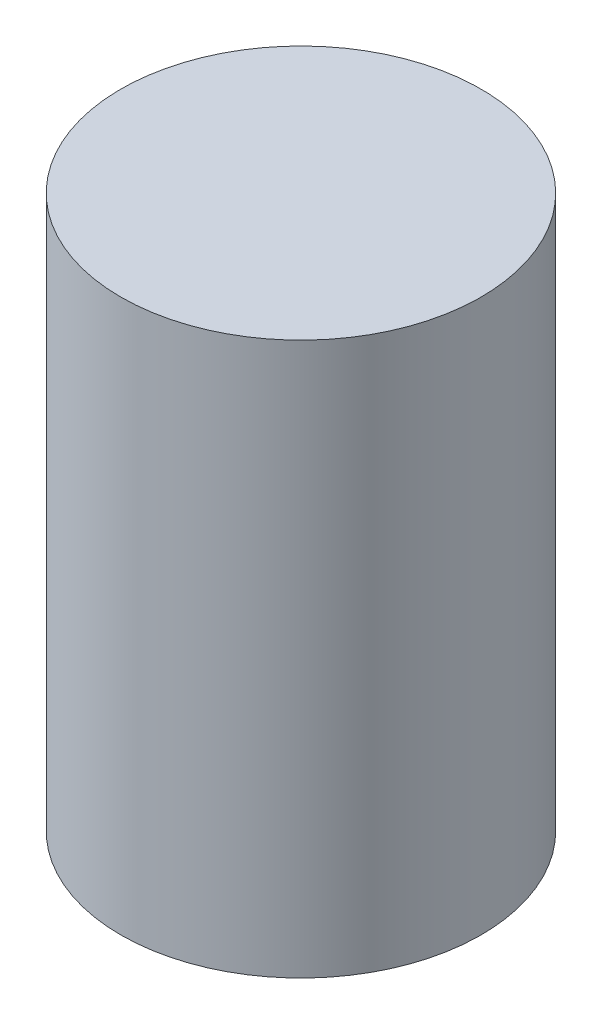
from build123d import *

# Parameters (mm, degrees)
SKETCH1_R           = 3.75
BOSS_EXTRUDE1_DEPTH = 11.5


with BuildPart() as part:
    # Sketch1 → Boss-Extrude1 (new body)
    with BuildSketch(Plane(origin=(0, 0, 0), x_dir=(1, 0, 0), z_dir=(0, 1, 0))):
        with Locations(Location((0, 0, 0), (0, 0, 270))):
            Circle(SKETCH1_R)
    extrude(amount=BOSS_EXTRUDE1_DEPTH)


solid = part.part
